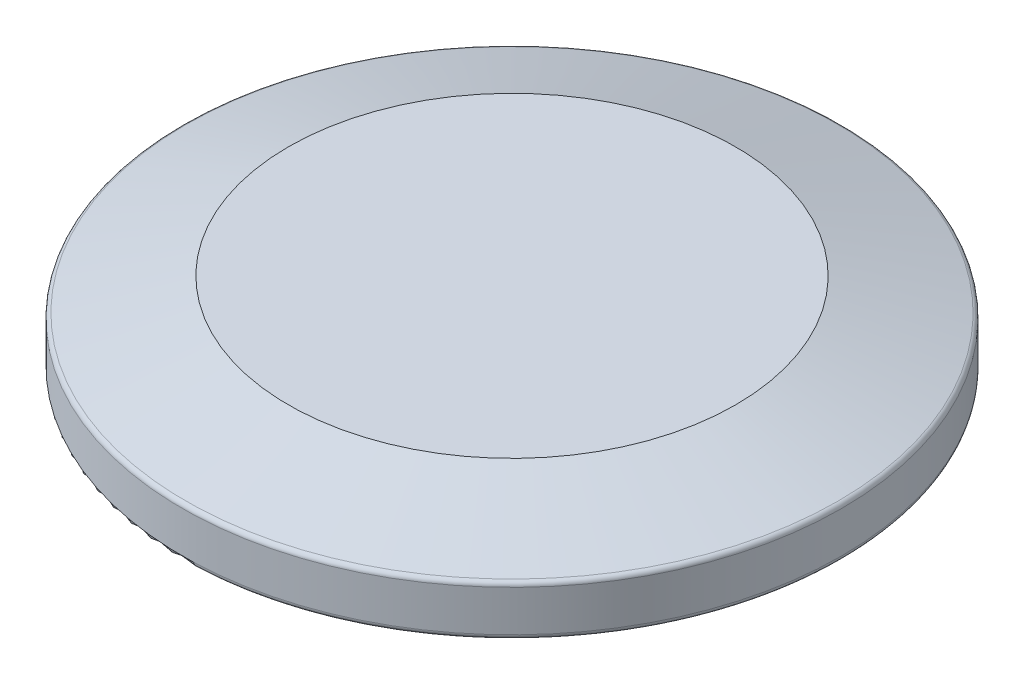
ISO-10303-21;
HEADER;
FILE_DESCRIPTION(('STEP AP214'),'2;1');
FILE_NAME('part.step','',(''),(''),'','','');
FILE_SCHEMA(('AUTOMOTIVE_DESIGN { 1 0 10303 214 1 1 1 1 }'));
ENDSEC;
DATA;
#1=APPLICATION_CONTEXT('core data for automotive mechanical design processes');
#2=APPLICATION_PROTOCOL_DEFINITION('international standard','automotive_design',2000,#1);
#3=PRODUCT_CONTEXT('',#1,'mechanical');
#4=PRODUCT('Part','Part','',(#3));
#5=PRODUCT_RELATED_PRODUCT_CATEGORY('part','',(#4));
#6=PRODUCT_DEFINITION_FORMATION('','',#4);
#7=PRODUCT_DEFINITION_CONTEXT('part definition',#1,'design');
#8=PRODUCT_DEFINITION('design','',#6,#7);
#9=PRODUCT_DEFINITION_SHAPE('','',#8);
#10=(LENGTH_UNIT() NAMED_UNIT(*) SI_UNIT(.MILLI.,.METRE.));
#11=(NAMED_UNIT(*) PLANE_ANGLE_UNIT() SI_UNIT($,.RADIAN.));
#12=(NAMED_UNIT(*) SI_UNIT($,.STERADIAN.) SOLID_ANGLE_UNIT());
#13=UNCERTAINTY_MEASURE_WITH_UNIT(LENGTH_MEASURE(1.E-05),#10,'distance_accuracy_value','');
#14=(GEOMETRIC_REPRESENTATION_CONTEXT(3) GLOBAL_UNCERTAINTY_ASSIGNED_CONTEXT((#13)) GLOBAL_UNIT_ASSIGNED_CONTEXT((#10,
#11,#12)) REPRESENTATION_CONTEXT('',''));
#15=CARTESIAN_POINT('',(0.,0.,0.));
#16=DIRECTION('',(0.,0.,1.));
#17=DIRECTION('',(1.,0.,0.));
#18=AXIS2_PLACEMENT_3D('',#15,#16,#17);
#19=CARTESIAN_POINT('',(0.,0.299999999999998,0.));
#20=DIRECTION('',(0.,1.,0.));
#21=DIRECTION('',(-1.,0.,0.));
#22=AXIS2_PLACEMENT_3D('',#19,#20,#21);
#23=TOROIDAL_SURFACE('',#22,13.5,0.3);
#24=CARTESIAN_POINT('',(0.,0.,0.));
#25=DIRECTION('',(0.,1.,0.));
#26=DIRECTION('',(-1.,0.,0.));
#27=AXIS2_PLACEMENT_3D('',#24,#25,#26);
#28=CIRCLE('',#27,13.5);
#29=CARTESIAN_POINT('',(-13.5,0.,0.));
#30=VERTEX_POINT('',#29);
#31=EDGE_CURVE('E52',#30,#30,#28,.T.);
#32=ORIENTED_EDGE('',*,*,#31,.F.);
#33=EDGE_LOOP('',(#32));
#34=FACE_BOUND('',#33,.T.);
#35=CARTESIAN_POINT('',(0.,0.299999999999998,0.));
#36=DIRECTION('',(0.,1.,0.));
#37=DIRECTION('',(-1.,0.,0.));
#38=AXIS2_PLACEMENT_3D('',#35,#36,#37);
#39=CIRCLE('',#38,13.2);
#40=CARTESIAN_POINT('',(-13.2,0.299999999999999,0.));
#41=VERTEX_POINT('',#40);
#42=EDGE_CURVE('E10',#41,#41,#39,.F.);
#43=ORIENTED_EDGE('',*,*,#42,.F.);
#44=EDGE_LOOP('',(#43));
#45=FACE_BOUND('',#44,.T.);
#46=ADVANCED_FACE('F45',(#34,#45),#23,.T.);
#47=CARTESIAN_POINT('',(0.,0.299999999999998,0.));
#48=DIRECTION('',(0.,1.,0.));
#49=DIRECTION('',(-1.,0.,0.));
#50=AXIS2_PLACEMENT_3D('',#47,#48,#49);
#51=TOROIDAL_SURFACE('',#50,19.6,0.3);
#52=CARTESIAN_POINT('',(0.,0.299999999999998,0.));
#53=DIRECTION('',(0.,1.,0.));
#54=DIRECTION('',(-1.,0.,0.));
#55=AXIS2_PLACEMENT_3D('',#52,#53,#54);
#56=CIRCLE('',#55,19.9);
#57=CARTESIAN_POINT('',(-19.9,0.299999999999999,0.));
#58=VERTEX_POINT('',#57);
#59=EDGE_CURVE('E62',#58,#58,#56,.T.);
#60=ORIENTED_EDGE('',*,*,#59,.F.);
#61=EDGE_LOOP('',(#60));
#62=FACE_BOUND('',#61,.T.);
#63=CARTESIAN_POINT('',(0.,0.,0.));
#64=DIRECTION('',(0.,1.,0.));
#65=DIRECTION('',(-1.,0.,0.));
#66=AXIS2_PLACEMENT_3D('',#63,#64,#65);
#67=CIRCLE('',#66,19.6);
#68=CARTESIAN_POINT('',(-19.6,0.,0.));
#69=VERTEX_POINT('',#68);
#70=EDGE_CURVE('E57',#69,#69,#67,.F.);
#71=ORIENTED_EDGE('',*,*,#70,.F.);
#72=EDGE_LOOP('',(#71));
#73=FACE_BOUND('',#72,.T.);
#74=ADVANCED_FACE('F108',(#62,#73),#51,.T.);
#75=CARTESIAN_POINT('',(0.,2.779442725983,0.));
#76=DIRECTION('',(0.,-1.,0.));
#77=DIRECTION('',(1.,0.,0.));
#78=AXIS2_PLACEMENT_3D('',#75,#76,#77);
#79=TOROIDAL_SURFACE('',#78,19.6,0.3);
#80=CARTESIAN_POINT('',(0.,3.0657867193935,0.));
#81=DIRECTION('',(0.,1.,0.));
#82=DIRECTION('',(-1.,0.,0.));
#83=AXIS2_PLACEMENT_3D('',#80,#81,#82);
#84=CIRCLE('',#83,19.6894824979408);
#85=CARTESIAN_POINT('',(-19.6894824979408,3.06578671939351,0.));
#86=VERTEX_POINT('',#85);
#87=EDGE_CURVE('E72',#86,#86,#84,.T.);
#88=ORIENTED_EDGE('',*,*,#87,.F.);
#89=EDGE_LOOP('',(#88));
#90=FACE_BOUND('',#89,.T.);
#91=CARTESIAN_POINT('',(0.,2.779442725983,0.));
#92=DIRECTION('',(0.,-1.,0.));
#93=DIRECTION('',(1.,0.,0.));
#94=AXIS2_PLACEMENT_3D('',#91,#92,#93);
#95=CIRCLE('',#94,19.9);
#96=CARTESIAN_POINT('',(19.9,2.77944272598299,0.));
#97=VERTEX_POINT('',#96);
#98=EDGE_CURVE('E68',#97,#97,#95,.T.);
#99=ORIENTED_EDGE('',*,*,#98,.F.);
#100=EDGE_LOOP('',(#99));
#101=FACE_BOUND('',#100,.T.);
#102=ADVANCED_FACE('F98',(#90,#101),#79,.T.);
#103=CARTESIAN_POINT('',(0.,2.5,0.));
#104=DIRECTION('',(0.,-1.,0.));
#105=DIRECTION('',(1.,0.,0.));
#106=AXIS2_PLACEMENT_3D('',#103,#104,#105);
#107=PLANE('',#106);
#108=CARTESIAN_POINT('',(0.,2.5,0.));
#109=DIRECTION('',(0.,1.,0.));
#110=DIRECTION('',(-1.,0.,0.));
#111=AXIS2_PLACEMENT_3D('',#108,#109,#110);
#112=CIRCLE('',#111,10.);
#113=CARTESIAN_POINT('',(-10.,2.5,0.));
#114=VERTEX_POINT('',#113);
#115=EDGE_CURVE('E76',#114,#114,#112,.T.);
#116=ORIENTED_EDGE('',*,*,#115,.T.);
#117=EDGE_LOOP('',(#116));
#118=FACE_BOUND('',#117,.T.);
#119=CARTESIAN_POINT('',(0.,2.5,0.));
#120=DIRECTION('',(0.,1.,0.));
#121=DIRECTION('',(-1.,0.,0.));
#122=AXIS2_PLACEMENT_3D('',#119,#120,#121);
#123=CIRCLE('',#122,13.2);
#124=CARTESIAN_POINT('',(-13.2,2.5,0.));
#125=VERTEX_POINT('',#124);
#126=EDGE_CURVE('E88',#125,#125,#123,.T.);
#127=ORIENTED_EDGE('',*,*,#126,.F.);
#128=EDGE_LOOP('',(#127));
#129=FACE_BOUND('',#128,.T.);
#130=ADVANCED_FACE('F95',(#118,#129),#107,.T.);
#131=CARTESIAN_POINT('',(0.,5.,0.));
#132=DIRECTION('',(0.,1.,0.));
#133=DIRECTION('',(-1.,0.,0.));
#134=AXIS2_PLACEMENT_3D('',#131,#132,#133);
#135=CYLINDRICAL_SURFACE('',#134,10.);
#136=CARTESIAN_POINT('',(0.,0.,0.));
#137=DIRECTION('',(0.,1.,0.));
#138=DIRECTION('',(-1.,0.,0.));
#139=AXIS2_PLACEMENT_3D('',#136,#137,#138);
#140=CIRCLE('',#139,10.);
#141=CARTESIAN_POINT('',(-10.,0.,0.));
#142=VERTEX_POINT('',#141);
#143=EDGE_CURVE('E80',#142,#142,#140,.T.);
#144=ORIENTED_EDGE('',*,*,#143,.T.);
#145=EDGE_LOOP('',(#144));
#146=FACE_BOUND('',#145,.T.);
#147=ORIENTED_EDGE('',*,*,#115,.F.);
#148=EDGE_LOOP('',(#147));
#149=FACE_BOUND('',#148,.T.);
#150=ADVANCED_FACE('F97',(#146,#149),#135,.T.);
#151=CARTESIAN_POINT('',(0.,0.,0.));
#152=DIRECTION('',(0.,1.,0.));
#153=DIRECTION('',(-1.,0.,0.));
#154=AXIS2_PLACEMENT_3D('',#151,#152,#153);
#155=PLANE('',#154);
#156=ORIENTED_EDGE('',*,*,#143,.F.);
#157=EDGE_LOOP('',(#156));
#158=FACE_BOUND('',#157,.T.);
#159=ADVANCED_FACE('F104',(#158),#155,.F.);
#160=CARTESIAN_POINT('',(0.,5.,0.));
#161=DIRECTION('',(0.,-1.,0.));
#162=DIRECTION('',(1.,0.,0.));
#163=AXIS2_PLACEMENT_3D('',#160,#161,#162);
#164=PLANE('',#163);
#165=CARTESIAN_POINT('',(0.,5.,0.));
#166=DIRECTION('',(0.,1.,0.));
#167=DIRECTION('',(-1.,0.,0.));
#168=AXIS2_PLACEMENT_3D('',#165,#166,#167);
#169=CIRCLE('',#168,13.5);
#170=CARTESIAN_POINT('',(-13.5,5.,0.));
#171=VERTEX_POINT('',#170);
#172=EDGE_CURVE('E84',#171,#171,#169,.T.);
#173=ORIENTED_EDGE('',*,*,#172,.T.);
#174=EDGE_LOOP('',(#173));
#175=FACE_BOUND('',#174,.T.);
#176=ADVANCED_FACE('F139',(#175),#164,.F.);
#177=CARTESIAN_POINT('',(0.,3.,0.));
#178=DIRECTION('',(0.,-1.,0.));
#179=DIRECTION('',(1.,0.,0.));
#180=AXIS2_PLACEMENT_3D('',#177,#178,#179);
#181=CONICAL_SURFACE('',#180,19.9,1.26791145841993);
#182=ORIENTED_EDGE('',*,*,#87,.T.);
#183=EDGE_LOOP('',(#182));
#184=FACE_BOUND('',#183,.T.);
#185=ORIENTED_EDGE('',*,*,#172,.F.);
#186=EDGE_LOOP('',(#185));
#187=FACE_BOUND('',#186,.T.);
#188=ADVANCED_FACE('F134',(#184,#187),#181,.T.);
#189=CARTESIAN_POINT('',(0.,5.,0.));
#190=DIRECTION('',(0.,1.,0.));
#191=DIRECTION('',(-1.,0.,0.));
#192=AXIS2_PLACEMENT_3D('',#189,#190,#191);
#193=CYLINDRICAL_SURFACE('',#192,19.9);
#194=ORIENTED_EDGE('',*,*,#59,.T.);
#195=EDGE_LOOP('',(#194));
#196=FACE_BOUND('',#195,.T.);
#197=ORIENTED_EDGE('',*,*,#98,.T.);
#198=EDGE_LOOP('',(#197));
#199=FACE_BOUND('',#198,.T.);
#200=ADVANCED_FACE('F128',(#196,#199),#193,.T.);
#201=CARTESIAN_POINT('',(0.,0.,0.));
#202=DIRECTION('',(0.,1.,0.));
#203=DIRECTION('',(-1.,0.,0.));
#204=AXIS2_PLACEMENT_3D('',#201,#202,#203);
#205=PLANE('',#204);
#206=ORIENTED_EDGE('',*,*,#31,.T.);
#207=EDGE_LOOP('',(#206));
#208=FACE_BOUND('',#207,.T.);
#209=ORIENTED_EDGE('',*,*,#70,.T.);
#210=EDGE_LOOP('',(#209));
#211=FACE_BOUND('',#210,.T.);
#212=ADVANCED_FACE('F127',(#208,#211),#205,.F.);
#213=CARTESIAN_POINT('',(0.,5.,0.));
#214=DIRECTION('',(0.,1.,0.));
#215=DIRECTION('',(-1.,0.,0.));
#216=AXIS2_PLACEMENT_3D('',#213,#214,#215);
#217=CYLINDRICAL_SURFACE('',#216,13.2);
#218=ORIENTED_EDGE('',*,*,#42,.T.);
#219=EDGE_LOOP('',(#218));
#220=FACE_BOUND('',#219,.T.);
#221=ORIENTED_EDGE('',*,*,#126,.T.);
#222=EDGE_LOOP('',(#221));
#223=FACE_BOUND('',#222,.T.);
#224=ADVANCED_FACE('F93',(#220,#223),#217,.F.);
#225=CLOSED_SHELL('',(#46,#74,#102,#130,#150,#159,#176,#188,#200,#212,#224));
#226=MANIFOLD_SOLID_BREP('B2',#225);
#227=ADVANCED_BREP_SHAPE_REPRESENTATION('',(#18,#226),#14);
#228=SHAPE_DEFINITION_REPRESENTATION(#9,#227);
ENDSEC;
END-ISO-10303-21;
